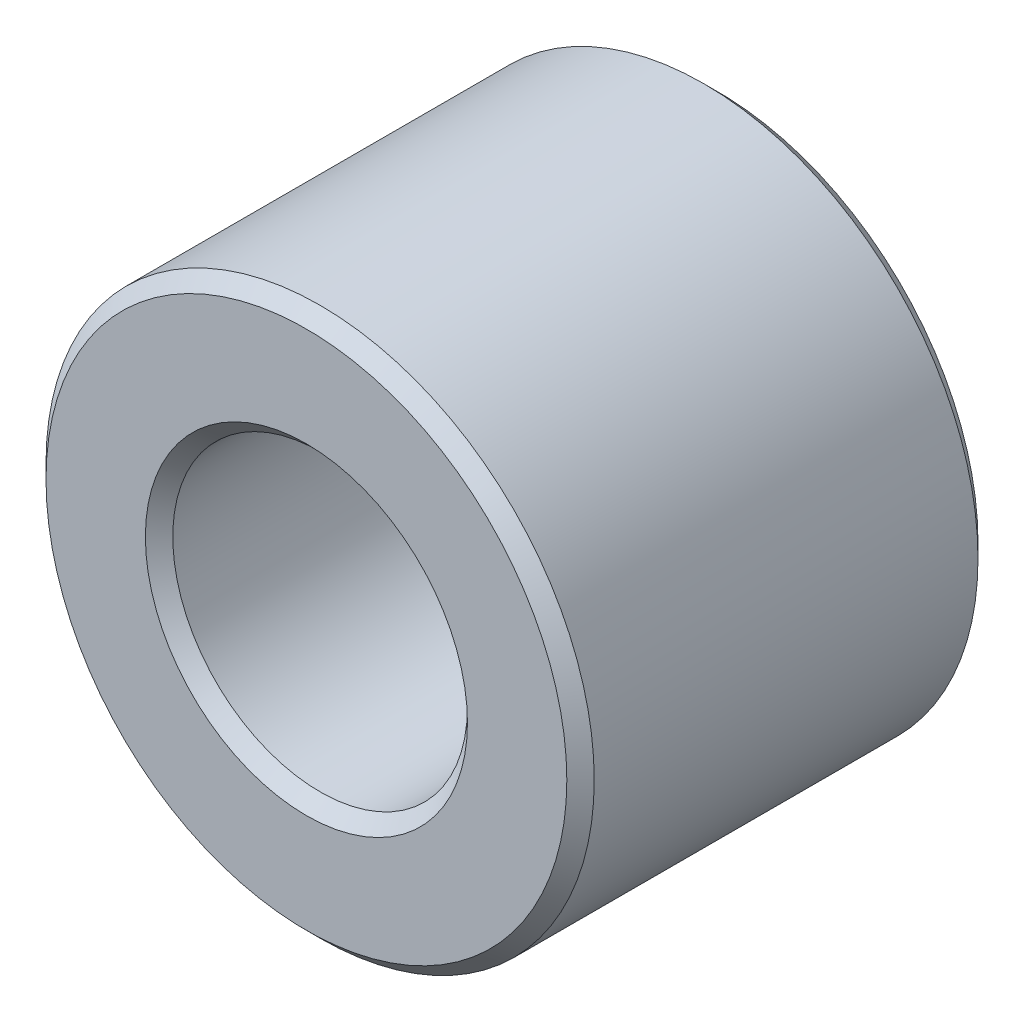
from build123d import *

# Parameters (mm, degrees)
SKETCH1_R           = 4
SKETCH1_R_2         = 2.15
BOSS_EXTRUDE2_DEPTH = 3
CHAMFER3_SIZE       = 0.2


with BuildPart() as part:
    # Sketch1 → Boss-Extrude2 (new, symmetric)
    with BuildSketch(Plane.XY):
        Circle(SKETCH1_R)
        Circle(SKETCH1_R_2, mode=Mode.SUBTRACT)
    extrude(amount=BOSS_EXTRUDE2_DEPTH, both=True)

    # Chamfer3
    chamfer3_edges = [part.edges().sort_by_distance(p)[0] for p in [
        (-4, 0, -3),
        (-4, 0, 3),
        (-2.15, 0, -3),
        (-2.15, 0, 3),
    ]]
    chamfer(chamfer3_edges, length=CHAMFER3_SIZE)


solid = part.part
